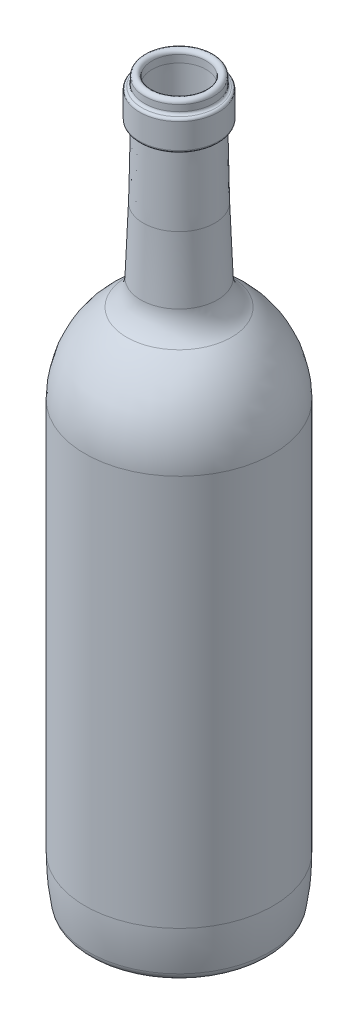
from build123d import *


with BuildPart() as part:
    # Skica1 → Rotovat1 (revolve)
    with BuildSketch(Plane.XY, mode=Mode.PRIVATE) as rotovat1_sk:
        with BuildLine():
            Line((-8.477605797, 6.777251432), (-30.929584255, 0.163033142))
            ThreePointArc((-30.929584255, 0.163033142), (-34.169375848, 0.601434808), (-36, 3.310172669))
            ThreePointArc((-36, 3.310172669), (-37.086818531, 11.623651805), (-37.45, 20))
            Line((-37.45, 20), (-37.45, 176))
            ThreePointArc((-37.45, 176), (-33.058133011, 193.979909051), (-20.871685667, 207.910311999))
            ThreePointArc((-20.871685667, 207.910311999), (-16.90629883, 212.311877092), (-15.25, 218))
            ThreePointArc((-15.25, 218), (-14.620475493, 230.995018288), (-14.25, 244))
            Line((-14.25, 244), (-13.75, 271))
            ThreePointArc((-13.75, 271), (-14.036265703, 271.719106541), (-14.75, 272.018515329))
            ThreePointArc((-14.75, 272.018515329), (-15.457096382, 272.311297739), (-15.75, 273.01834392))
            Line((-15.75, 273.01834392), (-15.75, 283.01834392))
            ThreePointArc((-15.75, 283.01834392), (-15.457106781, 283.725450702), (-14.75, 284.01834392))
            ThreePointArc((-14.75, 284.01834392), (-14.042893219, 284.311237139), (-13.75, 285.01834392))
            Line((-13.75, 285.01834392), (-13.75, 287.5))
            ThreePointArc((-13.75, 287.5), (-12.25, 289), (-10.75, 287.5))
            Line((-10.75, 287.5), (-10.783702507, 284.500189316))
            Line((-10.783702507, 284.500189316), (-10.750514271, 270.944453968))
            Line((-10.750514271, 270.944453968), (-11.250514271, 243.944453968))
            ThreePointArc((-11.250514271, 243.944453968), (-11.622691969, 230.879718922), (-12.255108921, 217.824993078))
            ThreePointArc((-12.255108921, 217.824993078), (-14.285626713, 210.851713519), (-19.146940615, 205.455672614))
            ThreePointArc((-19.146940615, 205.455672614), (-30.395968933, 192.596839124), (-34.45, 176))
            Line((-34.45, 176), (-34.45, 20))
            ThreePointArc((-34.45, 20), (-34.098076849, 11.883311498), (-33.044948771, 3.827543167))
            ThreePointArc((-33.044948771, 3.827543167), (-32.587292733, 3.150358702), (-31.777344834, 3.040758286))
            Line((-31.777344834, 3.040758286), (-9.325366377, 9.654976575))
            ThreePointArc((-9.325366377, 9.654976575), (-4.710932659, 10.66201331), (0, 11))
            Line((0, 11), (0, 8))
            ThreePointArc((0, 8), (-4.282666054, 7.692739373), (-8.477605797, 6.777251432))
        make_face()
    revolve(rotovat1_sk.sketch.rotate(Axis((0, 0, 0), (0, 1, 0)), 270), axis=Axis((0, 0, 0), (0, 1, 0)))


solid = part.part
